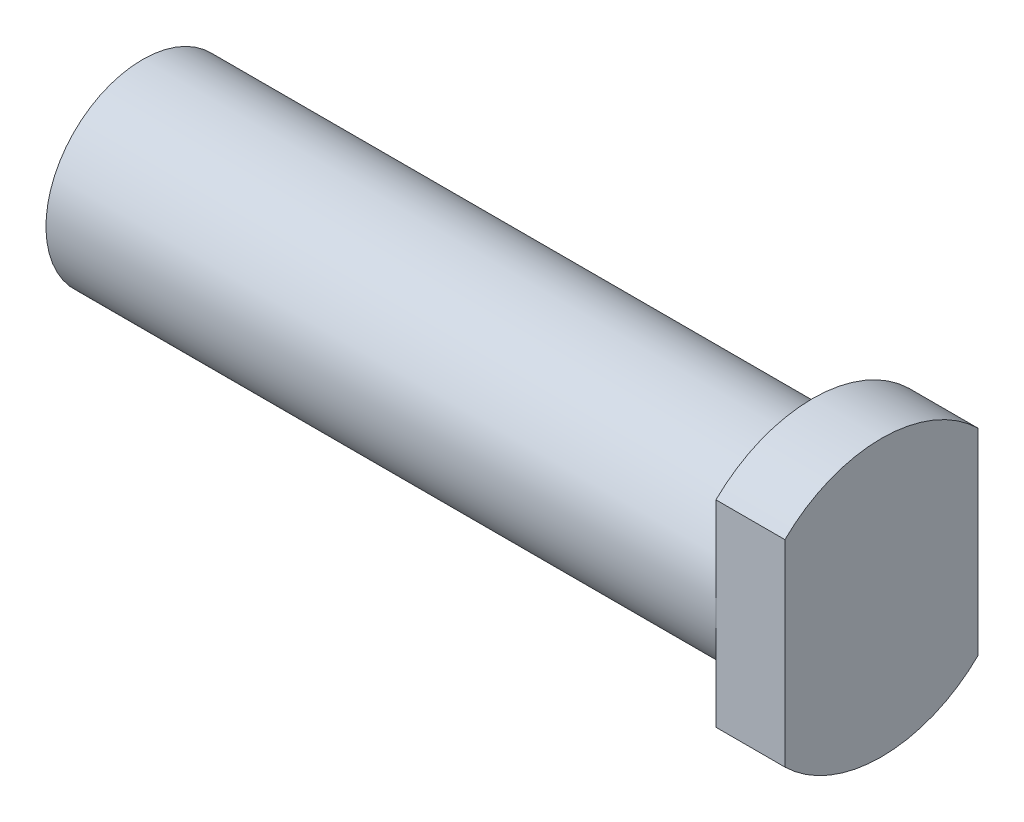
from build123d import *

# Parameters (mm, degrees)
ENL_V_MAT_EXTRU_1_DEPTH      = 56.412865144
ENL_V_MAT_EXTRU_1_DEPTH_BACK = 56.412865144
ESQUISSE3_W                  = 7
ESQUISSE3_H                  = 8.418630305
ESQUISSE3_H_2                = 9.161450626


with BuildPart() as part:
    # Esquisse1 → R_volution1 (revolve)
    with BuildSketch(Plane.XY):
        Polygon((0, 0), (0, 7), (48.577846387, 7), (48.577846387, 10), (53.577846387, 10), (53.577846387, 0), align=None)
    revolve(axis=Axis((53.577846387, 0, 0), (-1, 0, 0)))

    # Esquisse3 → Enl_v. mat.-Extru.1 (cut, two sides: drawn at the far end of the back side and taken through both)
    with BuildSketch(Plane(origin=(0, 0, 0), x_dir=(1, 0, 0), z_dir=(0, 1, 0)).offset(-ENL_V_MAT_EXTRU_1_DEPTH_BACK)):
        with Locations((51.077846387, 11.209315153)):
            Rectangle(ESQUISSE3_W, ESQUISSE3_H)
        with Locations((51.077846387, -11.580725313)):
            Rectangle(ESQUISSE3_W, ESQUISSE3_H_2)
    extrude(amount=ENL_V_MAT_EXTRU_1_DEPTH + ENL_V_MAT_EXTRU_1_DEPTH_BACK, mode=Mode.SUBTRACT)


solid = part.part
